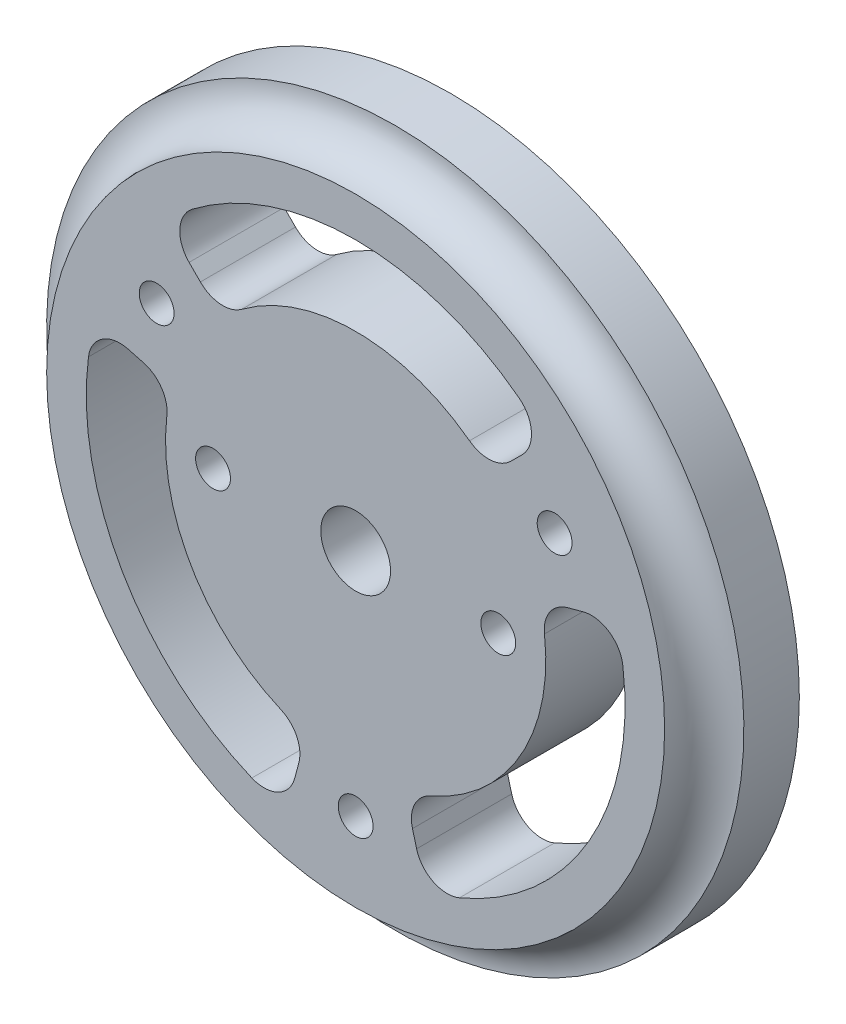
from build123d import *

# Parameters (mm, degrees)
ESQUISSE1_R      = 22
ESQUISSE1_R_2    = 2.2
ESQUISSE1_R_3    = 1.1
EXTRUSION1_DEPTH = 6


with BuildPart() as part:
    # Esquisse1 → Extrusion1 (new body)
    with BuildSketch(Plane.XY):
        Circle(ESQUISSE1_R)
        Circle(ESQUISSE1_R_2, mode=Mode.SUBTRACT)
        with Locations((0, -14.5)):
            Circle(ESQUISSE1_R_3, mode=Mode.SUBTRACT)
        with Locations((-12.557368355, 7.25)):
            Circle(ESQUISSE1_R_3, mode=Mode.SUBTRACT)
        with Locations((12.557368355, 7.25)):
            Circle(ESQUISSE1_R_3, mode=Mode.SUBTRACT)
        with Locations((-9, 0)):
            Circle(ESQUISSE1_R_3, mode=Mode.SUBTRACT)
        with Locations((9, 0)):
            Circle(ESQUISSE1_R_3, mode=Mode.SUBTRACT)
        with BuildLine():
            Line((9.797958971, 9.797958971), (10.511898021, 10.511898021))
            ThreePointArc((10.511898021, 10.511898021), (11.09321509, 12.059743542), (10.310709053, 13.516259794))
            ThreePointArc((10.310709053, 13.516259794), (0, 17), (-10.310709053, 13.516259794))
            ThreePointArc((-10.310709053, 13.516259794), (-11.09321509, 12.059743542), (-10.511898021, 10.511898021))
            Line((-10.511898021, 10.511898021), (-9.797958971, 9.797958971))
            ThreePointArc((-9.797958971, 9.797958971), (-8.526970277, 9.217307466), (-7.186067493, 9.6104336))
            ThreePointArc((-7.186067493, 9.6104336), (0, 12), (7.186067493, 9.6104336))
            ThreePointArc((7.186067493, 9.6104336), (8.526970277, 9.217307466), (9.797958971, 9.797958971))
        make_face(mode=Mode.SUBTRACT)
        with BuildLine():
            Line((13.38426086, 3.586301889), (14.359519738, 3.847621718))
            ThreePointArc((14.359519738, 3.847621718), (15.990651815, 3.577134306), (16.860778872, 2.171206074))
            ThreePointArc((16.860778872, 2.171206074), (14.722431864, -8.5), (6.55006982, -15.687465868))
            ThreePointArc((6.55006982, -15.687465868), (4.897436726, -15.636877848), (3.847621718, -14.359519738))
            Line((3.847621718, -14.359519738), (3.586301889, -13.38426086))
            ThreePointArc((3.586301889, -13.38426086), (3.718937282, -11.99322661), (4.729845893, -11.028533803))
            ThreePointArc((4.729845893, -11.028533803), (10.392304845, -6), (11.915913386, 1.418100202))
            ThreePointArc((11.915913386, 1.418100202), (12.245907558, 2.775919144), (13.38426086, 3.586301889))
        make_face(mode=Mode.SUBTRACT)
        with BuildLine():
            Line((-3.586301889, -13.38426086), (-3.847621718, -14.359519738))
            ThreePointArc((-3.847621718, -14.359519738), (-4.897436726, -15.636877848), (-6.55006982, -15.687465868))
            ThreePointArc((-6.55006982, -15.687465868), (-14.722431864, -8.5), (-16.860778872, 2.171206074))
            ThreePointArc((-16.860778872, 2.171206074), (-15.990651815, 3.577134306), (-14.359519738, 3.847621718))
            Line((-14.359519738, 3.847621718), (-13.38426086, 3.586301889))
            ThreePointArc((-13.38426086, 3.586301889), (-12.245907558, 2.775919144), (-11.915913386, 1.418100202))
            ThreePointArc((-11.915913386, 1.418100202), (-10.392304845, -6), (-4.729845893, -11.028533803))
            ThreePointArc((-4.729845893, -11.028533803), (-3.718937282, -11.99322661), (-3.586301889, -13.38426086))
        make_face(mode=Mode.SUBTRACT)
    extrude(amount=EXTRUSION1_DEPTH)

    # Esquisse2 → Enl_vement de mati_re-R_volution1 (revolve, cut)
    with BuildSketch(Plane(origin=(0, 0, 0), x_dir=(0, 0, -1), z_dir=(1, 0, 0))):
        with BuildLine():
            Line((-3.5, 22), (-6, 22))
            Line((-6, 22), (-6, 19.5))
            ThreePointArc((-6, 19.5), (-4.232233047, 20.232233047), (-3.5, 22))
        make_face()
    revolve(axis=Axis((0, 0, -18.92274783), (0, 0, 1)), mode=Mode.SUBTRACT)


solid = part.part
